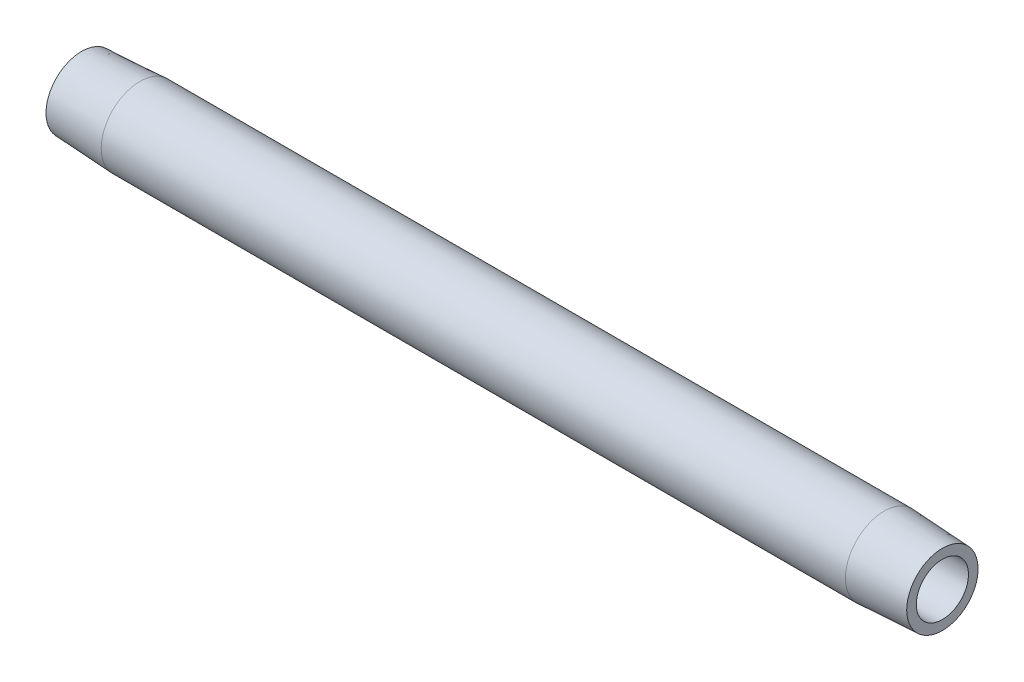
ISO-10303-21;
HEADER;
FILE_DESCRIPTION(('STEP AP214'),'2;1');
FILE_NAME('part.step','',(''),(''),'','','');
FILE_SCHEMA(('AUTOMOTIVE_DESIGN { 1 0 10303 214 1 1 1 1 }'));
ENDSEC;
DATA;
#1=APPLICATION_CONTEXT('core data for automotive mechanical design processes');
#2=APPLICATION_PROTOCOL_DEFINITION('international standard','automotive_design',2000,#1);
#3=PRODUCT_CONTEXT('',#1,'mechanical');
#4=PRODUCT('Part','Part','',(#3));
#5=PRODUCT_RELATED_PRODUCT_CATEGORY('part','',(#4));
#6=PRODUCT_DEFINITION_FORMATION('','',#4);
#7=PRODUCT_DEFINITION_CONTEXT('part definition',#1,'design');
#8=PRODUCT_DEFINITION('design','',#6,#7);
#9=PRODUCT_DEFINITION_SHAPE('','',#8);
#10=(LENGTH_UNIT() NAMED_UNIT(*) SI_UNIT(.MILLI.,.METRE.));
#11=(NAMED_UNIT(*) PLANE_ANGLE_UNIT() SI_UNIT($,.RADIAN.));
#12=(NAMED_UNIT(*) SI_UNIT($,.STERADIAN.) SOLID_ANGLE_UNIT());
#13=UNCERTAINTY_MEASURE_WITH_UNIT(LENGTH_MEASURE(1.E-05),#10,'distance_accuracy_value','');
#14=(GEOMETRIC_REPRESENTATION_CONTEXT(3) GLOBAL_UNCERTAINTY_ASSIGNED_CONTEXT((#13)) GLOBAL_UNIT_ASSIGNED_CONTEXT((#10,
#11,#12)) REPRESENTATION_CONTEXT('',''));
#15=CARTESIAN_POINT('',(0.,0.,0.));
#16=DIRECTION('',(0.,0.,1.));
#17=DIRECTION('',(1.,0.,0.));
#18=AXIS2_PLACEMENT_3D('',#15,#16,#17);
#19=CARTESIAN_POINT('',(152.4,0.,-4.62277681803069));
#20=DIRECTION('',(-1.,0.,0.));
#21=DIRECTION('',(0.,0.,1.));
#22=AXIS2_PLACEMENT_3D('',#19,#20,#21);
#23=PLANE('',#22);
#24=CARTESIAN_POINT('',(152.4,0.,0.));
#25=DIRECTION('',(-1.,0.,0.));
#26=DIRECTION('',(0.,0.,1.));
#27=AXIS2_PLACEMENT_3D('',#24,#25,#26);
#28=CIRCLE('',#27,6.31752683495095);
#29=CARTESIAN_POINT('',(152.4,0.,6.31752683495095));
#30=VERTEX_POINT('',#29);
#31=EDGE_CURVE('E10',#30,#30,#28,.T.);
#32=ORIENTED_EDGE('',*,*,#31,.F.);
#33=EDGE_LOOP('',(#32));
#34=FACE_BOUND('',#33,.T.);
#35=CARTESIAN_POINT('',(152.4,0.,0.));
#36=DIRECTION('',(-1.,0.,0.));
#37=DIRECTION('',(0.,0.,1.));
#38=AXIS2_PLACEMENT_3D('',#35,#36,#37);
#39=CIRCLE('',#38,4.62277681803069);
#40=CARTESIAN_POINT('',(152.4,0.,4.62277681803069));
#41=VERTEX_POINT('',#40);
#42=EDGE_CURVE('E52',#41,#41,#39,.T.);
#43=ORIENTED_EDGE('',*,*,#42,.T.);
#44=EDGE_LOOP('',(#43));
#45=FACE_BOUND('',#44,.T.);
#46=ADVANCED_FACE('F30',(#34,#45),#23,.F.);
#47=CARTESIAN_POINT('',(152.4,0.,0.));
#48=DIRECTION('',(-1.,0.,0.));
#49=DIRECTION('',(0.,0.,1.));
#50=AXIS2_PLACEMENT_3D('',#47,#48,#49);
#51=CONICAL_SURFACE('',#50,6.31752683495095,0.052359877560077);
#52=CARTESIAN_POINT('',(142.087600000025,0.,0.));
#53=DIRECTION('',(-1.,0.,0.));
#54=DIRECTION('',(0.,0.,1.));
#55=AXIS2_PLACEMENT_3D('',#52,#53,#54);
#56=CIRCLE('',#55,6.85797681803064);
#57=CARTESIAN_POINT('',(142.087600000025,0.,6.85797681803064));
#58=VERTEX_POINT('',#57);
#59=EDGE_CURVE('E36',#58,#58,#56,.T.);
#60=ORIENTED_EDGE('',*,*,#59,.F.);
#61=EDGE_LOOP('',(#60));
#62=FACE_BOUND('',#61,.T.);
#63=ORIENTED_EDGE('',*,*,#31,.T.);
#64=EDGE_LOOP('',(#63));
#65=FACE_BOUND('',#64,.T.);
#66=ADVANCED_FACE('F77',(#62,#65),#51,.T.);
#67=CARTESIAN_POINT('',(-6.37599469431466,0.,0.));
#68=DIRECTION('',(-1.,0.,0.));
#69=DIRECTION('',(0.,0.,1.));
#70=AXIS2_PLACEMENT_3D('',#67,#68,#69);
#71=CYLINDRICAL_SURFACE('',#70,6.85797681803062);
#72=CARTESIAN_POINT('',(10.3123999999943,0.,0.));
#73=DIRECTION('',(-1.,0.,0.));
#74=DIRECTION('',(0.,0.,1.));
#75=AXIS2_PLACEMENT_3D('',#72,#73,#74);
#76=CIRCLE('',#75,6.8579768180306);
#77=CARTESIAN_POINT('',(10.3123999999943,0.,6.8579768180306));
#78=VERTEX_POINT('',#77);
#79=EDGE_CURVE('E40',#78,#78,#76,.T.);
#80=ORIENTED_EDGE('',*,*,#79,.F.);
#81=EDGE_LOOP('',(#80));
#82=FACE_BOUND('',#81,.T.);
#83=ORIENTED_EDGE('',*,*,#59,.T.);
#84=EDGE_LOOP('',(#83));
#85=FACE_BOUND('',#84,.T.);
#86=ADVANCED_FACE('F72',(#82,#85),#71,.T.);
#87=CARTESIAN_POINT('',(10.3123999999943,0.,0.));
#88=DIRECTION('',(1.,0.,0.));
#89=DIRECTION('',(0.,0.,-1.));
#90=AXIS2_PLACEMENT_3D('',#87,#88,#89);
#91=CONICAL_SURFACE('',#90,6.8579768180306,0.0523598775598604);
#92=CARTESIAN_POINT('',(1.90819582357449E-11,0.,0.));
#93=DIRECTION('',(-1.,0.,0.));
#94=DIRECTION('',(0.,0.,1.));
#95=AXIS2_PLACEMENT_3D('',#92,#93,#94);
#96=CIRCLE('',#95,6.31752683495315);
#97=CARTESIAN_POINT('',(1.90819582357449E-11,0.,6.31752683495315));
#98=VERTEX_POINT('',#97);
#99=EDGE_CURVE('E44',#98,#98,#96,.T.);
#100=ORIENTED_EDGE('',*,*,#99,.F.);
#101=EDGE_LOOP('',(#100));
#102=FACE_BOUND('',#101,.T.);
#103=ORIENTED_EDGE('',*,*,#79,.T.);
#104=EDGE_LOOP('',(#103));
#105=FACE_BOUND('',#104,.T.);
#106=ADVANCED_FACE('F66',(#102,#105),#91,.T.);
#107=CARTESIAN_POINT('',(1.90819582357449E-11,0.,-6.31752683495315));
#108=DIRECTION('',(1.,0.,0.));
#109=DIRECTION('',(0.,0.,-1.));
#110=AXIS2_PLACEMENT_3D('',#107,#108,#109);
#111=PLANE('',#110);
#112=CARTESIAN_POINT('',(1.90819582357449E-11,0.,0.));
#113=DIRECTION('',(-1.,0.,0.));
#114=DIRECTION('',(0.,0.,1.));
#115=AXIS2_PLACEMENT_3D('',#112,#113,#114);
#116=CIRCLE('',#115,4.62277681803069);
#117=CARTESIAN_POINT('',(1.90819582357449E-11,0.,4.62277681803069));
#118=VERTEX_POINT('',#117);
#119=EDGE_CURVE('E49',#118,#118,#116,.T.);
#120=ORIENTED_EDGE('',*,*,#119,.F.);
#121=EDGE_LOOP('',(#120));
#122=FACE_BOUND('',#121,.T.);
#123=ORIENTED_EDGE('',*,*,#99,.T.);
#124=EDGE_LOOP('',(#123));
#125=FACE_BOUND('',#124,.T.);
#126=ADVANCED_FACE('F60',(#122,#125),#111,.F.);
#127=CARTESIAN_POINT('',(-6.37599469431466,0.,0.));
#128=DIRECTION('',(-1.,0.,0.));
#129=DIRECTION('',(0.,0.,1.));
#130=AXIS2_PLACEMENT_3D('',#127,#128,#129);
#131=CYLINDRICAL_SURFACE('',#130,4.62277681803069);
#132=ORIENTED_EDGE('',*,*,#42,.F.);
#133=EDGE_LOOP('',(#132));
#134=FACE_BOUND('',#133,.T.);
#135=ORIENTED_EDGE('',*,*,#119,.T.);
#136=EDGE_LOOP('',(#135));
#137=FACE_BOUND('',#136,.T.);
#138=ADVANCED_FACE('F57',(#134,#137),#131,.F.);
#139=CLOSED_SHELL('',(#46,#66,#86,#106,#126,#138));
#140=MANIFOLD_SOLID_BREP('B2',#139);
#141=ADVANCED_BREP_SHAPE_REPRESENTATION('',(#18,#140),#14);
#142=SHAPE_DEFINITION_REPRESENTATION(#9,#141);
ENDSEC;
END-ISO-10303-21;
